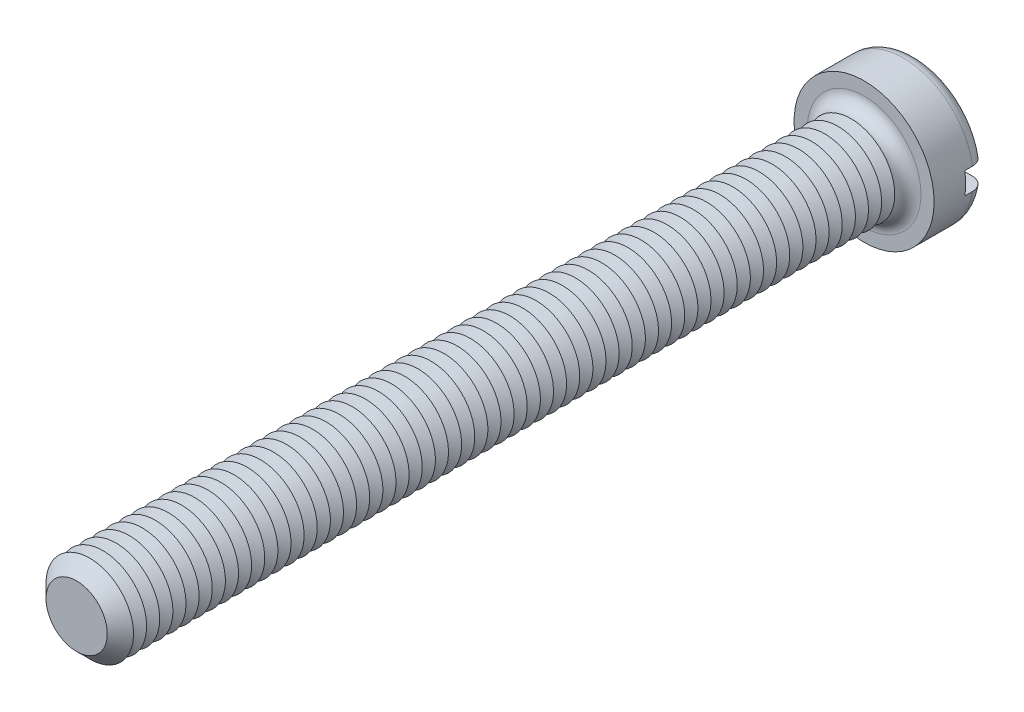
from build123d import *

# Parameters (mm, degrees)
SKETCH3_R           = 8
BOSS_EXTRUDE2_DEPTH = 6
SKETCH4_R           = 5
BOSS_EXTRUDE3_DEPTH = 90
FILLET1_R           = 1.5
CHAMFER1_SIZE       = 1.5
LPATTERN1_COUNT     = 58
LPATTERN1_PITCH     = 1.5
SKETCH8_W           = 16
SKETCH8_H           = 2.5
CUT_EXTRUDE1_DEPTH  = 2.4


with BuildPart() as part:
    # Sketch3 → Boss-Extrude2 (new body)
    with BuildSketch(Plane.XY):
        Circle(SKETCH3_R)
    extrude(amount=-BOSS_EXTRUDE2_DEPTH)

    # Sketch4 → Boss-Extrude3 (add)
    with BuildSketch(Plane.XY):
        with Locations(Location((0, 0, 0), (0, 0, 180))):
            Circle(SKETCH4_R)
    extrude(amount=BOSS_EXTRUDE3_DEPTH)

    # Fillet1
    fillet1_edges = [part.edges().sort_by_distance(p)[0] for p in [
        (-8, 0, -6),
        (5, 0, 0),
    ]]
    fillet(fillet1_edges, radius=FILLET1_R)

    # Chamfer1
    chamfer1_edges = [part.edges().sort_by_distance(p)[0] for p in [
        (5, 0, 90),
    ]]
    chamfer(chamfer1_edges, length=CHAMFER1_SIZE)

    # Sketch6 → Cut-Revolve1 (revolve, cut)
    with BuildSketch(Plane(origin=(0, 0, 0), x_dir=(0, 0, -1), z_dir=(1, 0, 0)), mode=Mode.PRIVATE) as cut_revolve1_sk:
        Polygon((-1.5, 5), (-2.25, 3.700961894), (-3, 5), align=None)
    cut_revolve1 = revolve(cut_revolve1_sk.sketch.rotate(Axis((0, 0, -1.694361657), (0, 0, 1)), 90), axis=Axis((0, 0, -1.694361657), (0, 0, 1)), mode=Mode.SUBTRACT)

    # LPattern1: Cut-Revolve1 ×58
    with Locations(*[(0, 0, i * LPATTERN1_PITCH) for i in range(1, LPATTERN1_COUNT)]):
        add(cut_revolve1, mode=Mode.SUBTRACT)

    # Sketch8 → Cut-Extrude1 (cut)
    with BuildSketch(Plane(origin=(0, 0, -6), x_dir=(-1, 0, 0), z_dir=(0, 0, -1))):
        Rectangle(SKETCH8_W, SKETCH8_H)
    extrude(amount=-CUT_EXTRUDE1_DEPTH, mode=Mode.SUBTRACT)


solid = part.part
